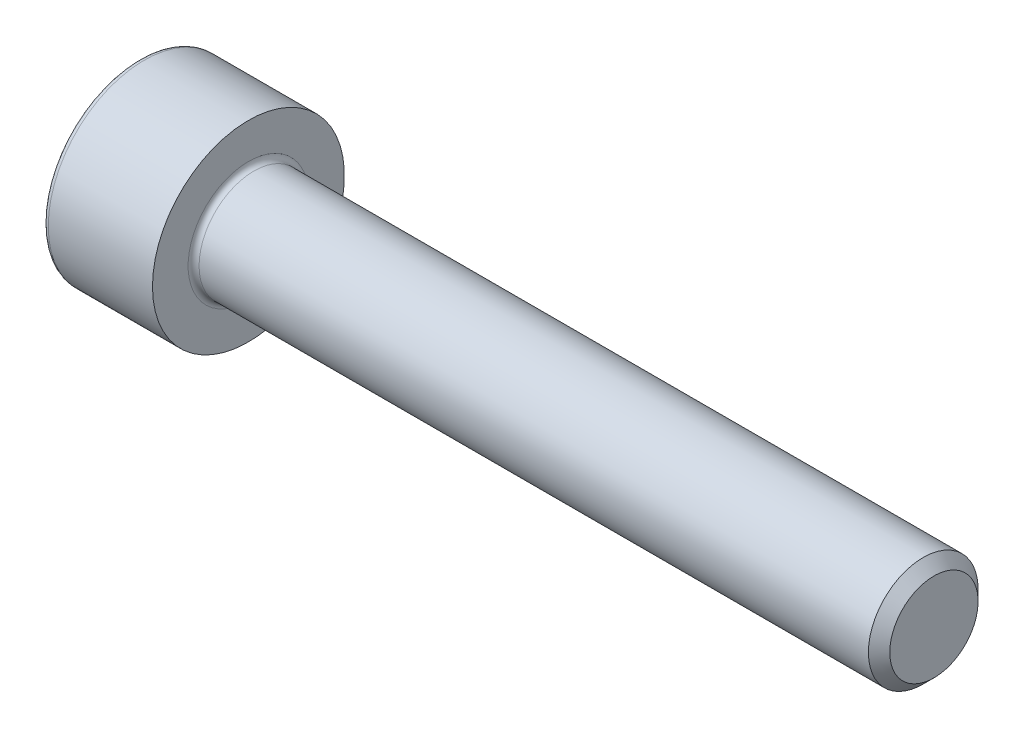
from build123d import *

# Parameters (mm, degrees)
FILLET1_R   = 0.2
FILLET2_R   = 0.2
HEX_2_DEPTH = 2


with BuildPart() as part:
    # BodySke → Base-Revolve (revolve)
    with BuildSketch(Plane.XY, mode=Mode.PRIVATE) as base_revolve_sk:
        Polygon((0, 0), (0, 3.5), (4, 3.5), (4, 2), (28.61, 2), (29, 1.61), (29, 0), align=None)
    revolve(base_revolve_sk.sketch.rotate(Axis((-31.75, 0, 0), (1, 0, 0)), 90), axis=Axis((-31.75, 0, 0), (1, 0, 0)))

    # Fillet1
    fillet1_edges = [part.edges().sort_by_distance(p)[0] for p in [
        (4, 0, -2),
    ]]
    fillet(fillet1_edges, radius=FILLET1_R)

    # Fillet2
    fillet2_edges = [part.edges().sort_by_distance(p)[0] for p in [
        (0, 0, -3.5),
    ]]
    fillet(fillet2_edges, radius=FILLET2_R)

    # Sketch2 → Hex-PreBroach (revolve, cut)
    with BuildSketch(Plane.XY, mode=Mode.PRIVATE) as hex_prebroach_sk:
        Polygon((0, 1.5355), (2, 1.5355), (2.886521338, 0), (0, 0), align=None)
    revolve(hex_prebroach_sk.sketch.rotate(Axis((0, 0, 0), (1, 0, 0)), 90), axis=Axis((0, 0, 0), (1, 0, 0)), mode=Mode.SUBTRACT)

    # Sketch3 → Hex 2 (cut)
    with BuildSketch(Plane(origin=(0, 0, 0), x_dir=(0, 0.500000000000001, 0.866025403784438), z_dir=(-1, 0, 0))):
        Polygon((0.886521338, 1.5355), (-0.886521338, 1.5355), (-1.773042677, 0), (-0.886521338, -1.5355), (0.886521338, -1.5355), (1.773042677, 0), align=None)
    extrude(amount=-HEX_2_DEPTH, mode=Mode.SUBTRACT)


solid = part.part
